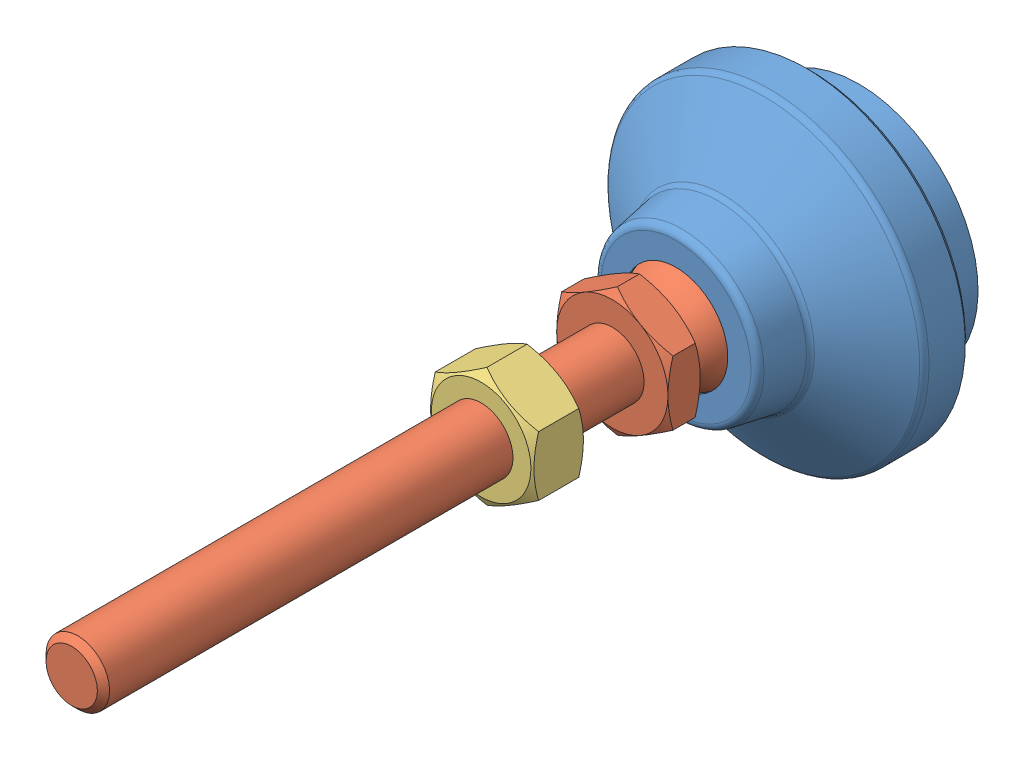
SolidWorks assembly LSVA40-M8X68-SUS.sldasm, configuration Default (file format 15000). Lengths in mm.
Overall size (40 40 99).
3 component instances, 3 part files, 0 mates.
Components (placement in the parent):
- LSVA40-M8X68-SUS_01-1: LSVA40-M8X68-SUS_01.sldprt [ﾃﾞﾌｫﾙﾄ] at origin size (40 40 23)
- LSVA40-M8X68-SUS_02-1: LSVA40-M8X68-SUS_02.sldprt [ﾃﾞﾌｫﾙﾄ] at (0 0 20.15) x (1 0 0) z (0 -1 0) size (14 85.85 16.17)
- LSVA40-M8X68-SUS_03-1: LSVA40-M8X68-SUS_03.sldprt [ﾃﾞﾌｫﾙﾄ] at (0 0 41) size (13 15.01 6.5)
